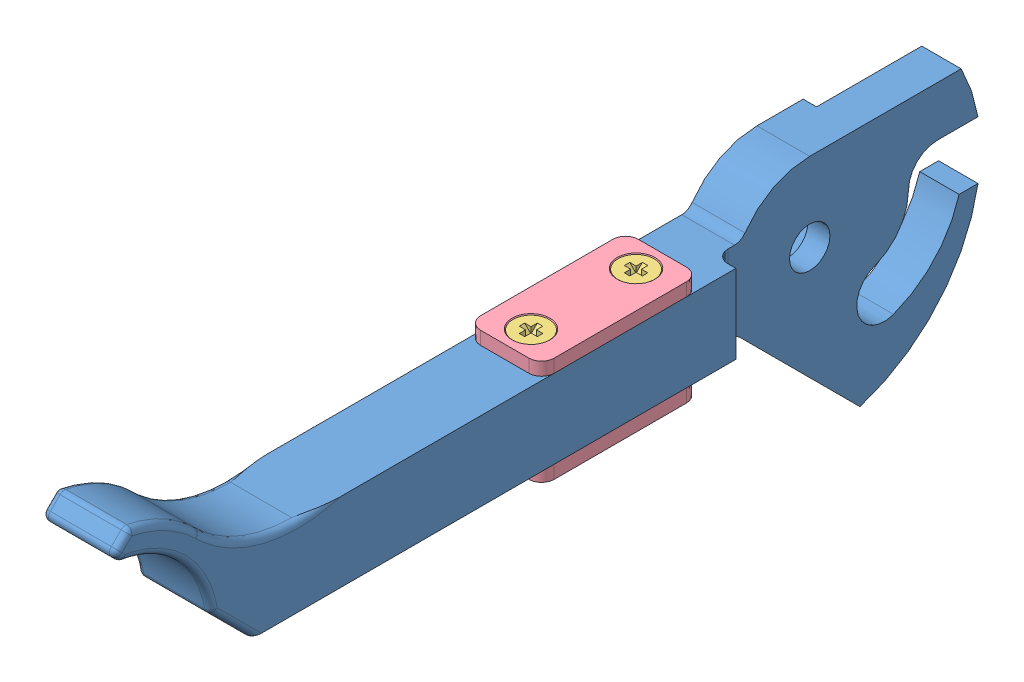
SolidWorks assembly Clevis arm assy-2.SLDASM, configuration Default (file format 10000). Lengths in mm.
Overall size (9.27 34.01 106.72).
12 component instances, 4 part files, 5 mates.
Components (placement in the parent):
- A9SP-1500-M561-4_ASM-1: A9SP-1500-M561-4_ASM.sldasm [Default] at (-54.7895 -6.1276 1.9013) size (9.27 34.01 106.72)
  - A9SP-1500-M561-41_AF0-1: A9SP-1500-M561-41_AF0.sldprt [Default] x (1 0 0) z (0 0 -1) size (9.27 34.01 106.72)
  - 93365A110_MMC_BRASS_INSERT-1: 93365A110_MMC_BRASS_INSERT.sldprt [Default] at (0 4.7625 19.05) x (0 0 -1) z (1 0 0) size (3.58 2.96 3.58)
  - 93365A110_MMC_BRASS_INSERT-2: 93365A110_MMC_BRASS_INSERT.sldprt [Default] at (0 4.7625 31.75) x (0 0 -1) z (1 0 0) size (3.58 2.96 3.58)
  - 93365A110_MMC_BRASS_INSERT-3: 93365A110_MMC_BRASS_INSERT.sldprt [Default] at (0 -4.7625 31.75) x (0 0 1) z (1 0 0) size (3.58 2.96 3.58)
  - 93365A110_MMC_BRASS_INSERT-4: 93365A110_MMC_BRASS_INSERT.sldprt [Default] at (0 -4.7625 19.05) x (0 0 1) z (1 0 0) size (3.58 2.96 3.58)
- MMC_93085A015-1: MMC_93085A015.sldprt [Default] at (-54.7895 0.1371 33.6513) x (1 0 0) z (0 1 0) size (4.37 4.37 4.75)
- A9SP-1500-M561-5-1: A9SP-1500-M561-5.sldprt [Default] at (-54.7895 -1.3651 27.3013) x (0 1 0) z (-1 0 0) size (1.59 19.05 8.89)
- MMC_93085A015-2: MMC_93085A015.sldprt [Default] at (-54.7895 0.1371 20.9513) x (1 0 0) z (0 1 0) size (4.37 4.37 4.75)
- MMC_93085A015-3: MMC_93085A015.sldprt [Default] at (-54.7895 -12.3924 33.6513) x (-1 0 0) z (0 -1 0) size (4.37 4.37 4.75)
- A9SP-1500-M561-5-2: A9SP-1500-M561-5.sldprt [Default] at (-54.7895 -10.8901 27.3013) x (0 -1 0) z (1 0 0) size (1.59 19.05 8.89)
- MMC_93085A015-4: MMC_93085A015.sldprt [Default] at (-54.7895 -12.3924 20.9513) x (-1 0 0) z (0 -1 0) size (4.37 4.37 4.75)
Mates (geometry in assembly coordinates):
- Coincident1: coincident aligned: cone of MMC_93085A015-1 through (-54.7895 0.1371 33.6513) axis (0 -1 0); cone of A9SP-1500-M561-5-1 through (-54.7895 0.2224 33.6513) axis (0 -1 0)
- Coincident2: coincident aligned: cone of A9SP-1500-M561-5-1 through (-54.7895 0.2224 20.9513) axis (0 -1 0); cone of MMC_93085A015-2 through (-54.7895 0.1371 20.9513) axis (0 -1 0)
- Coincident3: coincident anti-aligned: axis of A9SP-1500-M561-4_ASM-1/93365A110_MMC_BRASS_INSERT-2 through (-54.7895 -3.338 33.6513) axis (0 1 0); axis of MMC_93085A015-1 through (-54.7895 -0.7793 33.6513) axis (0 -1 0)
- Coincident6: coincident anti-aligned: plane of A9SP-1500-M561-4_ASM-1/A9SP-1500-M561-41_AF0-1 through (-66.6818 -1.3651 10.1502) normal (0 1 0); plane of A9SP-1500-M561-5-1 through (-54.7895 -1.3651 27.3013) normal (0 -1 0)
- Coincident7: coincident anti-aligned: axis of A9SP-1500-M561-4_ASM-1/93365A110_MMC_BRASS_INSERT-1 through (-54.7895 -4.2226 20.9513) axis (0 1 0); axis of MMC_93085A015-2 through (-54.7895 -0.7793 20.9513) axis (0 -1 0)
